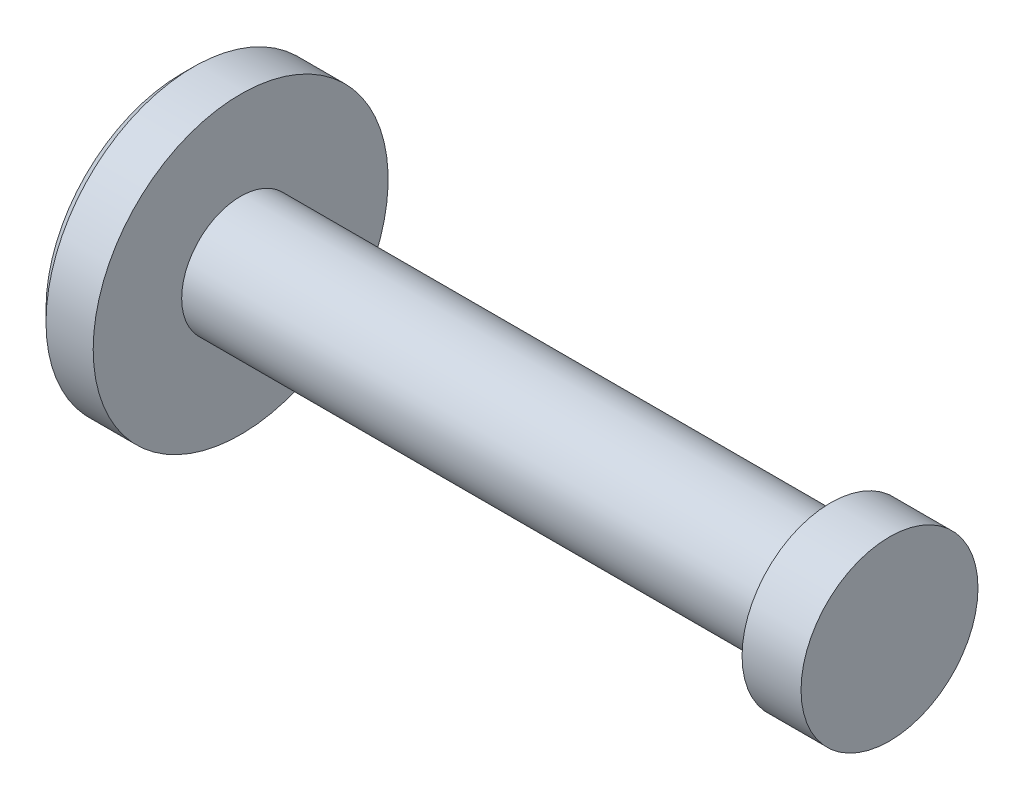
ISO-10303-21;
HEADER;
FILE_DESCRIPTION(('STEP AP214'),'2;1');
FILE_NAME('part.step','',(''),(''),'','','');
FILE_SCHEMA(('AUTOMOTIVE_DESIGN { 1 0 10303 214 1 1 1 1 }'));
ENDSEC;
DATA;
#1=APPLICATION_CONTEXT('core data for automotive mechanical design processes');
#2=APPLICATION_PROTOCOL_DEFINITION('international standard','automotive_design',2000,#1);
#3=PRODUCT_CONTEXT('',#1,'mechanical');
#4=PRODUCT('Part','Part','',(#3));
#5=PRODUCT_RELATED_PRODUCT_CATEGORY('part','',(#4));
#6=PRODUCT_DEFINITION_FORMATION('','',#4);
#7=PRODUCT_DEFINITION_CONTEXT('part definition',#1,'design');
#8=PRODUCT_DEFINITION('design','',#6,#7);
#9=PRODUCT_DEFINITION_SHAPE('','',#8);
#10=(LENGTH_UNIT() NAMED_UNIT(*) SI_UNIT(.MILLI.,.METRE.));
#11=(NAMED_UNIT(*) PLANE_ANGLE_UNIT() SI_UNIT($,.RADIAN.));
#12=(NAMED_UNIT(*) SI_UNIT($,.STERADIAN.) SOLID_ANGLE_UNIT());
#13=UNCERTAINTY_MEASURE_WITH_UNIT(LENGTH_MEASURE(1.E-05),#10,'distance_accuracy_value','');
#14=(GEOMETRIC_REPRESENTATION_CONTEXT(3) GLOBAL_UNCERTAINTY_ASSIGNED_CONTEXT((#13)) GLOBAL_UNIT_ASSIGNED_CONTEXT((#10,
#11,#12)) REPRESENTATION_CONTEXT('',''));
#15=CARTESIAN_POINT('',(0.,0.,0.));
#16=DIRECTION('',(0.,0.,1.));
#17=DIRECTION('',(1.,0.,0.));
#18=AXIS2_PLACEMENT_3D('',#15,#16,#17);
#19=CARTESIAN_POINT('',(-12.,-2.5,0.));
#20=DIRECTION('',(-1.,0.,0.));
#21=DIRECTION('',(0.,0.,1.));
#22=AXIS2_PLACEMENT_3D('',#19,#20,#21);
#23=PLANE('',#22);
#24=CARTESIAN_POINT('',(-12.,0.,0.));
#25=DIRECTION('',(-1.,0.,0.));
#26=DIRECTION('',(0.,0.,1.));
#27=AXIS2_PLACEMENT_3D('',#24,#25,#26);
#28=CIRCLE('',#27,2.29999999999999);
#29=CARTESIAN_POINT('',(-12.,0.,2.29999999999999));
#30=VERTEX_POINT('',#29);
#31=EDGE_CURVE('E36',#30,#30,#28,.T.);
#32=ORIENTED_EDGE('',*,*,#31,.T.);
#33=EDGE_LOOP('',(#32));
#34=FACE_BOUND('',#33,.T.);
#35=ADVANCED_FACE('F30',(#34),#23,.T.);
#36=CARTESIAN_POINT('',(-90.,0.,0.));
#37=DIRECTION('',(-1.,0.,0.));
#38=DIRECTION('',(0.,0.,1.));
#39=AXIS2_PLACEMENT_3D('',#36,#37,#38);
#40=CYLINDRICAL_SURFACE('',#39,2.5);
#41=CARTESIAN_POINT('',(-11.8,0.,0.));
#42=DIRECTION('',(-1.,0.,0.));
#43=DIRECTION('',(0.,0.,1.));
#44=AXIS2_PLACEMENT_3D('',#41,#42,#43);
#45=CIRCLE('',#44,2.5);
#46=CARTESIAN_POINT('',(-11.8,0.,2.5));
#47=VERTEX_POINT('',#46);
#48=EDGE_CURVE('E10',#47,#47,#45,.F.);
#49=ORIENTED_EDGE('',*,*,#48,.T.);
#50=EDGE_LOOP('',(#49));
#51=FACE_BOUND('',#50,.T.);
#52=CARTESIAN_POINT('',(-11.,0.,0.));
#53=DIRECTION('',(-1.,0.,0.));
#54=DIRECTION('',(0.,0.,1.));
#55=AXIS2_PLACEMENT_3D('',#52,#53,#54);
#56=CIRCLE('',#55,2.49999999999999);
#57=CARTESIAN_POINT('',(-11.,0.,2.49999999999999));
#58=VERTEX_POINT('',#57);
#59=EDGE_CURVE('E40',#58,#58,#56,.T.);
#60=ORIENTED_EDGE('',*,*,#59,.T.);
#61=EDGE_LOOP('',(#60));
#62=FACE_BOUND('',#61,.T.);
#63=ADVANCED_FACE('F75',(#51,#62),#40,.T.);
#64=CARTESIAN_POINT('',(-11.,-1.,0.));
#65=DIRECTION('',(1.,0.,0.));
#66=DIRECTION('',(0.,0.,-1.));
#67=AXIS2_PLACEMENT_3D('',#64,#65,#66);
#68=PLANE('',#67);
#69=CARTESIAN_POINT('',(-11.,0.,0.));
#70=DIRECTION('',(-1.,0.,0.));
#71=DIRECTION('',(0.,0.,1.));
#72=AXIS2_PLACEMENT_3D('',#69,#70,#71);
#73=CIRCLE('',#72,1.);
#74=CARTESIAN_POINT('',(-11.,0.,1.));
#75=VERTEX_POINT('',#74);
#76=EDGE_CURVE('E44',#75,#75,#73,.T.);
#77=ORIENTED_EDGE('',*,*,#76,.T.);
#78=EDGE_LOOP('',(#77));
#79=FACE_BOUND('',#78,.T.);
#80=ORIENTED_EDGE('',*,*,#59,.F.);
#81=EDGE_LOOP('',(#80));
#82=FACE_BOUND('',#81,.T.);
#83=ADVANCED_FACE('F79',(#79,#82),#68,.T.);
#84=CARTESIAN_POINT('',(-90.,0.,0.));
#85=DIRECTION('',(-1.,0.,0.));
#86=DIRECTION('',(0.,0.,1.));
#87=AXIS2_PLACEMENT_3D('',#84,#85,#86);
#88=CYLINDRICAL_SURFACE('',#87,1.);
#89=CARTESIAN_POINT('',(-1.,0.,0.));
#90=DIRECTION('',(-1.,0.,0.));
#91=DIRECTION('',(0.,0.,1.));
#92=AXIS2_PLACEMENT_3D('',#89,#90,#91);
#93=CIRCLE('',#92,0.999999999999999);
#94=CARTESIAN_POINT('',(-1.,0.,0.999999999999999));
#95=VERTEX_POINT('',#94);
#96=EDGE_CURVE('E49',#95,#95,#93,.T.);
#97=ORIENTED_EDGE('',*,*,#96,.T.);
#98=EDGE_LOOP('',(#97));
#99=FACE_BOUND('',#98,.T.);
#100=ORIENTED_EDGE('',*,*,#76,.F.);
#101=EDGE_LOOP('',(#100));
#102=FACE_BOUND('',#101,.T.);
#103=ADVANCED_FACE('F83',(#99,#102),#88,.T.);
#104=CARTESIAN_POINT('',(-0.999999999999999,-1.5,0.));
#105=DIRECTION('',(-1.,0.,0.));
#106=DIRECTION('',(0.,0.,1.));
#107=AXIS2_PLACEMENT_3D('',#104,#105,#106);
#108=PLANE('',#107);
#109=CARTESIAN_POINT('',(-1.,0.,0.));
#110=DIRECTION('',(-1.,0.,0.));
#111=DIRECTION('',(0.,0.,1.));
#112=AXIS2_PLACEMENT_3D('',#109,#110,#111);
#113=CIRCLE('',#112,1.5);
#114=CARTESIAN_POINT('',(-1.,0.,1.5));
#115=VERTEX_POINT('',#114);
#116=EDGE_CURVE('E52',#115,#115,#113,.T.);
#117=ORIENTED_EDGE('',*,*,#116,.T.);
#118=EDGE_LOOP('',(#117));
#119=FACE_BOUND('',#118,.T.);
#120=ORIENTED_EDGE('',*,*,#96,.F.);
#121=EDGE_LOOP('',(#120));
#122=FACE_BOUND('',#121,.T.);
#123=ADVANCED_FACE('F72',(#119,#122),#108,.T.);
#124=CARTESIAN_POINT('',(-90.,0.,0.));
#125=DIRECTION('',(-1.,0.,0.));
#126=DIRECTION('',(0.,0.,1.));
#127=AXIS2_PLACEMENT_3D('',#124,#125,#126);
#128=CYLINDRICAL_SURFACE('',#127,1.5);
#129=CARTESIAN_POINT('',(0.,0.,0.));
#130=DIRECTION('',(-1.,0.,0.));
#131=DIRECTION('',(0.,0.,1.));
#132=AXIS2_PLACEMENT_3D('',#129,#130,#131);
#133=CIRCLE('',#132,1.5);
#134=CARTESIAN_POINT('',(0.,0.,1.5));
#135=VERTEX_POINT('',#134);
#136=EDGE_CURVE('E55',#135,#135,#133,.T.);
#137=ORIENTED_EDGE('',*,*,#136,.T.);
#138=EDGE_LOOP('',(#137));
#139=FACE_BOUND('',#138,.T.);
#140=ORIENTED_EDGE('',*,*,#116,.F.);
#141=EDGE_LOOP('',(#140));
#142=FACE_BOUND('',#141,.T.);
#143=ADVANCED_FACE('F59',(#139,#142),#128,.T.);
#144=CARTESIAN_POINT('',(0.,0.,0.));
#145=DIRECTION('',(1.,0.,0.));
#146=DIRECTION('',(0.,0.,-1.));
#147=AXIS2_PLACEMENT_3D('',#144,#145,#146);
#148=PLANE('',#147);
#149=ORIENTED_EDGE('',*,*,#136,.F.);
#150=EDGE_LOOP('',(#149));
#151=FACE_BOUND('',#150,.T.);
#152=ADVANCED_FACE('F62',(#151),#148,.T.);
#153=CARTESIAN_POINT('',(-12.,0.,0.));
#154=DIRECTION('',(1.,0.,0.));
#155=DIRECTION('',(0.,0.,-1.));
#156=AXIS2_PLACEMENT_3D('',#153,#154,#155);
#157=CONICAL_SURFACE('',#156,2.29999999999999,0.785398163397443);
#158=ORIENTED_EDGE('',*,*,#48,.F.);
#159=EDGE_LOOP('',(#158));
#160=FACE_BOUND('',#159,.T.);
#161=ORIENTED_EDGE('',*,*,#31,.F.);
#162=EDGE_LOOP('',(#161));
#163=FACE_BOUND('',#162,.T.);
#164=ADVANCED_FACE('F64',(#160,#163),#157,.T.);
#165=CLOSED_SHELL('',(#35,#63,#83,#103,#123,#143,#152,#164));
#166=MANIFOLD_SOLID_BREP('B2',#165);
#167=ADVANCED_BREP_SHAPE_REPRESENTATION('',(#18,#166),#14);
#168=SHAPE_DEFINITION_REPRESENTATION(#9,#167);
ENDSEC;
END-ISO-10303-21;
